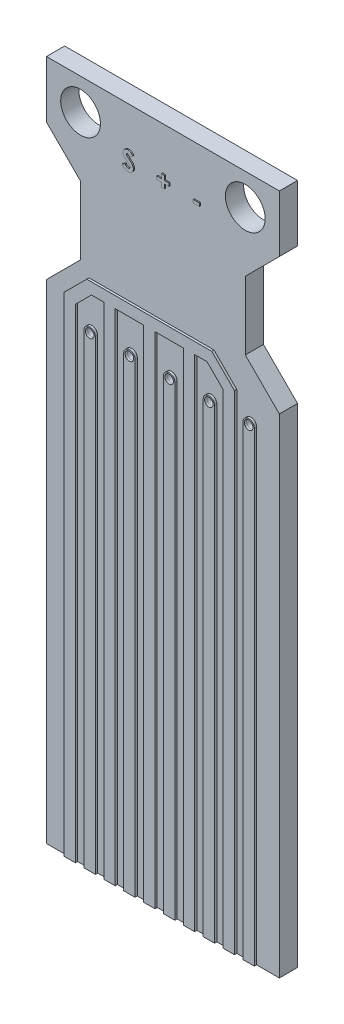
from build123d import *

# Parameters (mm, degrees)
ESQUISSE1_R      = 1.75
ESQUISSE1_R_2    = 0.4
EXTRUSION1_DEPTH = 1.6
ESQUISSE2_R      = 0.380865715
EXTRUSION2_DEPTH = 0.2
EXTRUSION3_DEPTH = 0.2
ESQUISSE4_W      = 0.549519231
ESQUISSE4_H      = 0.264583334
EXTRUSION4_DEPTH = 0.1


with BuildPart() as part:
    # Esquisse1 → Extrusion1 (new body)
    with BuildSketch(Plane.XY):
        Polygon((20.5, 55), (17.5, 51.999999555), (17.5, 45.999999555), (20.5, 43), (20.5, 0), (0, 0), (0, 43), (3, 45.999999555), (3, 51.999999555), (0, 55), (0, 60), (20.5, 60), align=None)
        with Locations((17.5, 57.25)):
            Circle(ESQUISSE1_R, mode=Mode.SUBTRACT)
        with Locations(Location((3, 57.25, 0), (0, 0, 180))):
            Circle(ESQUISSE1_R, mode=Mode.SUBTRACT)
        with Locations((4, 41)):
            Circle(ESQUISSE1_R_2, mode=Mode.SUBTRACT)
        with Locations((7.5, 41)):
            Circle(ESQUISSE1_R_2, mode=Mode.SUBTRACT)
        with Locations((11, 41)):
            Circle(ESQUISSE1_R_2, mode=Mode.SUBTRACT)
        with Locations((14.5, 41)):
            Circle(ESQUISSE1_R_2, mode=Mode.SUBTRACT)
        with Locations((18, 41)):
            Circle(ESQUISSE1_R_2, mode=Mode.SUBTRACT)
    extrude(amount=EXTRUSION1_DEPTH)

    # Esquisse2 → Extrusion2 (add)
    # profile 1 of 5: a face of its own
    with BuildSketch(Plane.XY.offset(1.6)):
        with BuildLine():
            Line((7, 41), (7, 0))
            Line((7, 0), (8, 0))
            Line((8, 0), (8, 41))
            ThreePointArc((8, 41), (7.5, 41.5), (7, 41))
        make_face()
        with Locations((7.5, 41)):
            Circle(ESQUISSE2_R, mode=Mode.SUBTRACT)
    # profile 2 of 5: a face of its own
    with BuildSketch(Plane.XY.offset(1.6)):
        with BuildLine():
            Line((3.5, 41), (3.5, 0))
            Line((3.5, 0), (4.5, 0))
            Line((4.5, 0), (4.5, 41))
            ThreePointArc((4.5, 41), (4, 41.5), (3.5, 41))
        make_face()
        with Locations((4, 41)):
            Circle(ESQUISSE2_R, mode=Mode.SUBTRACT)
    # profile 3 of 5: a face of its own
    with BuildSketch(Plane.XY.offset(1.6)):
        with BuildLine():
            Line((10.5, 41), (10.5, 0))
            Line((10.5, 0), (11.5, 0))
            Line((11.5, 0), (11.5, 41))
            ThreePointArc((11.5, 41), (11, 41.5), (10.5, 41))
        make_face()
        with Locations((11, 41)):
            Circle(ESQUISSE2_R, mode=Mode.SUBTRACT)
    # profile 4 of 5: a face of its own
    with BuildSketch(Plane.XY.offset(1.6)):
        with BuildLine():
            Line((14, 41), (14, 0))
            Line((14, 0), (15, 0))
            Line((15, 0), (15, 41))
            ThreePointArc((15, 41), (14.5, 41.5), (14, 41))
        make_face()
        with Locations((14.5, 41)):
            Circle(ESQUISSE2_R, mode=Mode.SUBTRACT)
    # profile 5 of 5: a face of its own
    with BuildSketch(Plane.XY.offset(1.6)):
        with BuildLine():
            Line((17.5, 41), (17.5, 0))
            Line((17.5, 0), (18.5, 0))
            Line((18.5, 0), (18.5, 41))
            ThreePointArc((18.5, 41), (18, 41.5), (17.5, 41))
        make_face()
        with Locations((18, 41)):
            Circle(ESQUISSE2_R, mode=Mode.SUBTRACT)
    extrude(amount=EXTRUSION2_DEPTH)

    # Esquisse3 → Extrusion3 (add)
    with BuildSketch(Plane.XY.offset(1.6)):
        Polygon((14.335786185, 44), (13.25, 44), (13.25, 0), (12.25, 0), (12.25, 44), (9.75, 44), (9.75, 0), (8.75, 0), (8.75, 44), (6.25, 44), (6.25, 0), (5.25, 0), (5.25, 44), (4.164213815, 44), (2.75, 42.585786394), (2.75, 0), (1.75, 0), (1.75, 43), (3.750000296, 45), (14.749999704, 45), (16.75, 43), (16.75, 0), (15.75, 0), (15.75, 42.585786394), align=None)
    extrude(amount=EXTRUSION3_DEPTH)

    # Esquisse4 → Extrusion4 (add)
    with BuildSketch(Plane.XY.offset(1.6)):
        with BuildLine():
            Line((7.702626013, 56.317143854), (7.489560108, 56.122204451))
            add(Edge.make_bspline(
                [(7.489560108, 56.122204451), (7.480433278, 56.135078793), (7.462911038, 56.159795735), (7.434509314, 56.192892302), (7.406235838, 56.221126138), (7.377828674, 56.244379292), (7.349036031, 56.262510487), (7.31990789, 56.275347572), (7.290609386, 56.28350823), (7.270925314, 56.284524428), (7.261229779, 56.285024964)],
                knots=[0, 0, 0, 0, 1.299362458, 2.494594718, 3.587462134, 4.587049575, 5.512617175, 6.380583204, 7.202344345, 8, 8, 8, 8], degree=3))
            add(Edge.make_bspline(
                [(7.261229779, 56.285024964), (7.252186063, 56.284707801), (7.234725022, 56.284095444), (7.209833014, 56.278008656), (7.187733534, 56.267503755), (7.168448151, 56.253767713), (7.153171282, 56.237218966), (7.140973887, 56.219863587), (7.134105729, 56.200707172), (7.133201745, 56.187549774), (7.132754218, 56.181036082)],
                knots=[0, 0, 0, 0, 1.185010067, 2.2879431, 3.333075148, 4.379039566, 5.372662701, 6.27520591, 7.14612461, 8, 8, 8, 8], degree=3))
            add(Edge.make_bspline(
                [(7.132754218, 56.181036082), (7.13303466, 56.174428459), (7.133599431, 56.161121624), (7.139054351, 56.141618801), (7.147276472, 56.122562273), (7.155133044, 56.110961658), (7.15914895, 56.105031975)],
                knots=[0, 0, 0, 0, 0.967525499, 1.948461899, 2.951351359, 4, 4, 4, 4], degree=3))
            add(Edge.make_bspline(
                [(7.15914895, 56.105031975), (7.162799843, 56.100422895), (7.171203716, 56.089813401), (7.187228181, 56.073009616), (7.207351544, 56.052423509), (7.232348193, 56.028762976), (7.26118045, 56.00117709), (7.295184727, 55.970750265), (7.333382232, 55.936540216), (7.360532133, 55.912717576), (7.374758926, 55.900234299)],
                knots=[0, 0, 0, 0, 0.473873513, 1.090794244, 1.870441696, 2.795289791, 3.865433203, 5.087734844, 6.473946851, 8, 8, 8, 8], degree=3))
            add(Edge.make_bspline(
                [(7.374758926, 55.900234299), (7.388112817, 55.888677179), (7.413455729, 55.866744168), (7.44951366, 55.835613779), (7.481202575, 55.807606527), (7.508984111, 55.783142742), (7.532437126, 55.761965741), (7.551660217, 55.743974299), (7.566888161, 55.729518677), (7.575544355, 55.720787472), (7.579238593, 55.717061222)],
                knots=[0, 0, 0, 0, 1.543621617, 2.929473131, 4.163658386, 5.240097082, 6.164993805, 6.925417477, 7.541396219, 8, 8, 8, 8], degree=3))
            add(Edge.make_bspline(
                [(7.579238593, 55.717061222), (7.593253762, 55.701893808), (7.620195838, 55.672736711), (7.655211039, 55.627552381), (7.684029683, 55.583443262), (7.706324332, 55.539579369), (7.723162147, 55.495327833), (7.73503303, 55.449603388), (7.742142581, 55.401928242), (7.742931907, 55.369395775), (7.743331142, 55.35294113)],
                knots=[0, 0, 0, 0, 1.206664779, 2.319633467, 3.337109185, 4.282041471, 5.190008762, 6.099243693, 7.03861361, 8, 8, 8, 8], degree=3))
            add(Edge.make_bspline(
                [(7.743331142, 55.35294113), (7.743046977, 55.336908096), (7.742489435, 55.305450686), (7.735660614, 55.259417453), (7.725923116, 55.215361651), (7.710867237, 55.17376267), (7.69251722, 55.133937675), (7.669512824, 55.096507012), (7.642497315, 55.061091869), (7.611533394, 55.028325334), (7.577283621, 54.998591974), (7.540547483, 54.972122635), (7.500965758, 54.950268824), (7.458876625, 54.93227377), (7.414302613, 54.918413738), (7.367296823, 54.908169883), (7.317787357, 54.902021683), (7.283932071, 54.901378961), (7.266635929, 54.901050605)],
                knots=[0, 0, 0, 0, 1.043214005, 2.046824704, 3.02475056, 3.976699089, 4.921714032, 5.875962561, 6.831408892, 7.817874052, 8.806269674, 9.781291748, 10.760897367, 11.74438705, 12.757449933, 13.795994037, 14.874007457, 16, 16, 16, 16], degree=3))
            add(Edge.make_bspline(
                [(7.266635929, 54.901050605), (7.253058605, 54.901291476), (7.226167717, 54.901768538), (7.186534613, 54.905663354), (7.148264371, 54.911949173), (7.111400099, 54.92095863), (7.075775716, 54.932374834), (7.041389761, 54.946319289), (7.008479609, 54.96300813), (6.976796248, 54.982098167), (6.946493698, 55.004264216), (6.917188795, 55.029053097), (6.889172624, 55.056846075), (6.862310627, 55.087577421), (6.836774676, 55.121334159), (6.811728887, 55.157646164), (6.788286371, 55.197187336), (6.773804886, 55.224925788), (6.766408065, 55.239093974)],
                knots=[0, 0, 0, 0, 1.016823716, 2.013894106, 2.979844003, 3.91962641, 4.853723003, 5.779685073, 6.695824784, 7.614987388, 8.547259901, 9.504950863, 10.487499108, 11.500346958, 12.559593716, 13.656357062, 14.802919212, 16, 16, 16, 16], degree=3))
            Line((6.766408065, 55.239093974), (7.01699901, 55.389512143))
            add(Edge.make_bspline(
                [(7.01699901, 55.389512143), (7.026251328, 55.373429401), (7.043988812, 55.34259741), (7.074046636, 55.301170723), (7.104839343, 55.265695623), (7.137078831, 55.236799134), (7.170373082, 55.214094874), (7.204882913, 55.197868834), (7.240632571, 55.187824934), (7.264983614, 55.186598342), (7.27713022, 55.185986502)],
                knots=[0, 0, 0, 0, 1.283663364, 2.460892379, 3.537111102, 4.529833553, 5.449777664, 6.316464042, 7.160231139, 8, 8, 8, 8], degree=3))
            add(Edge.make_bspline(
                [(7.27713022, 55.185986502), (7.289485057, 55.186486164), (7.31345524, 55.187455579), (7.34766961, 55.196409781), (7.379038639, 55.210468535), (7.406153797, 55.230528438), (7.429113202, 55.253680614), (7.446058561, 55.279438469), (7.45670375, 55.307307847), (7.457829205, 55.32666775), (7.458395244, 55.336404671)],
                knots=[0, 0, 0, 0, 1.13588714, 2.203786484, 3.234766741, 4.283437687, 5.291419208, 6.222934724, 7.106237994, 8, 8, 8, 8], degree=3))
            add(Edge.make_bspline(
                [(7.458395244, 55.336404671), (7.45787253, 55.345463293), (7.456810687, 55.363865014), (7.448989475, 55.391225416), (7.436762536, 55.418573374), (7.422297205, 55.441004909), (7.407576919, 55.459786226), (7.393501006, 55.476059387), (7.376360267, 55.494038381), (7.356198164, 55.513745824), (7.33328109, 55.535355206), (7.307589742, 55.558864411), (7.278829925, 55.584066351), (7.258502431, 55.601233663), (7.247873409, 55.61021026)],
                knots=[0, 0, 0, 0, 0.916159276, 1.861089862, 2.860218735, 3.940849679, 4.552606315, 5.27541173, 6.11797699, 7.06649574, 8.129236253, 9.306560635, 10.591630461, 12, 12, 12, 12], degree=3))
            add(Edge.make_bspline(
                [(7.247873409, 55.61021026), (7.227667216, 55.627306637), (7.188885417, 55.660119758), (7.134081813, 55.708583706), (7.084698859, 55.753877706), (7.041163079, 55.79656169), (7.00291976, 55.835847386), (6.970227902, 55.872053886), (6.94344664, 55.905460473), (6.915265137, 55.94502834), (6.888487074, 55.993244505), (6.865343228, 56.051254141), (6.850328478, 56.109256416), (6.848646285, 56.148195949), (6.847818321, 56.167361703)],
                knots=[0, 0, 0, 0, 1.345494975, 2.582412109, 3.71882943, 4.751509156, 5.681369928, 6.505683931, 7.230279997, 7.856715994, 8.973648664, 10.023341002, 11.027102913, 12, 12, 12, 12], degree=3))
            add(Edge.make_bspline(
                [(6.847818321, 56.167361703), (6.84816267, 56.180953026), (6.848841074, 56.207729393), (6.854892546, 56.247100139), (6.863936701, 56.285089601), (6.87707141, 56.321559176), (6.894118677, 56.356463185), (6.914821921, 56.389972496), (6.939502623, 56.421778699), (6.967316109, 56.451860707), (6.997959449, 56.479352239), (7.030705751, 56.503616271), (7.06536967, 56.524110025), (7.101739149, 56.541111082), (7.140039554, 56.554124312), (7.179988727, 56.563348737), (7.22164397, 56.568835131), (7.249976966, 56.569580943), (7.264409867, 56.569960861)],
                knots=[0, 0, 0, 0, 1.010766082, 1.991317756, 2.957454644, 3.913069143, 4.869106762, 5.843196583, 6.838735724, 7.860187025, 8.887984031, 9.89767229, 10.887916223, 11.879572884, 12.879850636, 13.892031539, 14.926195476, 16, 16, 16, 16], degree=3))
            add(Edge.make_bspline(
                [(7.264409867, 56.569960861), (7.283114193, 56.569276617), (7.320375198, 56.56791353), (7.375466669, 56.557254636), (7.429277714, 56.540492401), (7.472639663, 56.520270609), (7.507141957, 56.50068175), (7.533584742, 56.482646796), (7.560491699, 56.461986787), (7.588079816, 56.438636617), (7.615836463, 56.41215634), (7.644550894, 56.383176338), (7.67383184, 56.351446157), (7.692859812, 56.328778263), (7.702626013, 56.317143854)],
                knots=[0, 0, 0, 0, 1.282922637, 2.555718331, 3.837320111, 5.142675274, 5.830281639, 6.55870424, 7.337177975, 8.157850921, 9.037902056, 9.96903443, 10.957596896, 12, 12, 12, 12], degree=3))
        make_face()
        Polygon((10.205991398, 55.837268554), (10.205991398, 56.223967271), (10.470574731, 56.223967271), (10.470574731, 55.837268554), (10.877626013, 55.837268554), (10.877626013, 55.57268522), (10.470574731, 55.57268522), (10.470574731, 55.185986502), (10.205991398, 55.185986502), (10.205991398, 55.57268522), (9.798940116, 55.57268522), (9.798940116, 55.837268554), align=None)
        with Locations((13.289404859, 55.52180381)):
            Rectangle(ESQUISSE4_W, ESQUISSE4_H)
    extrude(amount=EXTRUSION4_DEPTH)


solid = part.part
